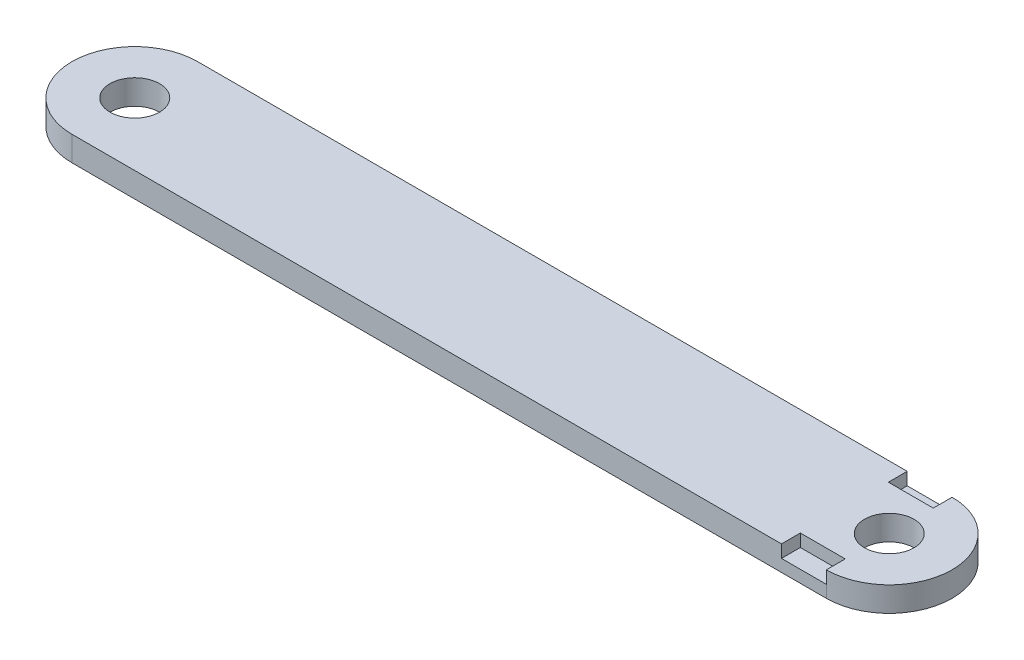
from build123d import *

# Parameters (mm, degrees)
BOSS_EXTRUDE1_DEPTH = 5
SKETCH2_R           = 5
CUT_EXTRUDE1_DEPTH  = 5
SKETCH3_W           = 9.069614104
SKETCH3_H           = 3.81
CUT_EXTRUDE2_DEPTH  = 2.54


with BuildPart() as part:
    # Sketch1 → Boss-Extrude1 (new body)
    with BuildSketch(Plane(origin=(0, 0, 0), x_dir=(1, 0, 0), z_dir=(0, 1, 0))):
        with BuildLine():
            Line((-73.554166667, 11.377083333), (78.845833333, 11.377083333))
            ThreePointArc((78.845833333, 11.377083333), (91.545833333, -1.322916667), (78.845833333, -14.022916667))
            Line((78.845833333, -14.022916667), (-73.554166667, -14.022916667))
            ThreePointArc((-73.554166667, -14.022916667), (-86.254166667, -1.322916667), (-73.554166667, 11.377083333))
        make_face()
    extrude(amount=BOSS_EXTRUDE1_DEPTH)

    # Sketch2 → Cut-Extrude1 (cut)
    with BuildSketch(Plane(origin=(0, 0, 0), x_dir=(1, 0, 0), z_dir=(0, 1, 0))):
        with Locations(Location((-73.554166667, -1.322916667, 0), (0, 0, 270))):
            Circle(SKETCH2_R)
        with Locations(Location((78.845833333, -1.322916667, 0), (0, 0, 270))):
            Circle(SKETCH2_R)
    extrude(amount=CUT_EXTRUDE1_DEPTH, mode=Mode.SUBTRACT)

    # Sketch3 → Cut-Extrude2 (cut)
    with BuildSketch(Plane(origin=(0, 5, 0), x_dir=(1, 0, 0), z_dir=(0, 1, 0))):
        with Locations((74.311026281, 9.472083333)):
            Rectangle(SKETCH3_W, SKETCH3_H)
        with Locations((74.311026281, -12.117916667)):
            Rectangle(SKETCH3_W, SKETCH3_H)
    extrude(amount=-CUT_EXTRUDE2_DEPTH, mode=Mode.SUBTRACT)


solid = part.part
